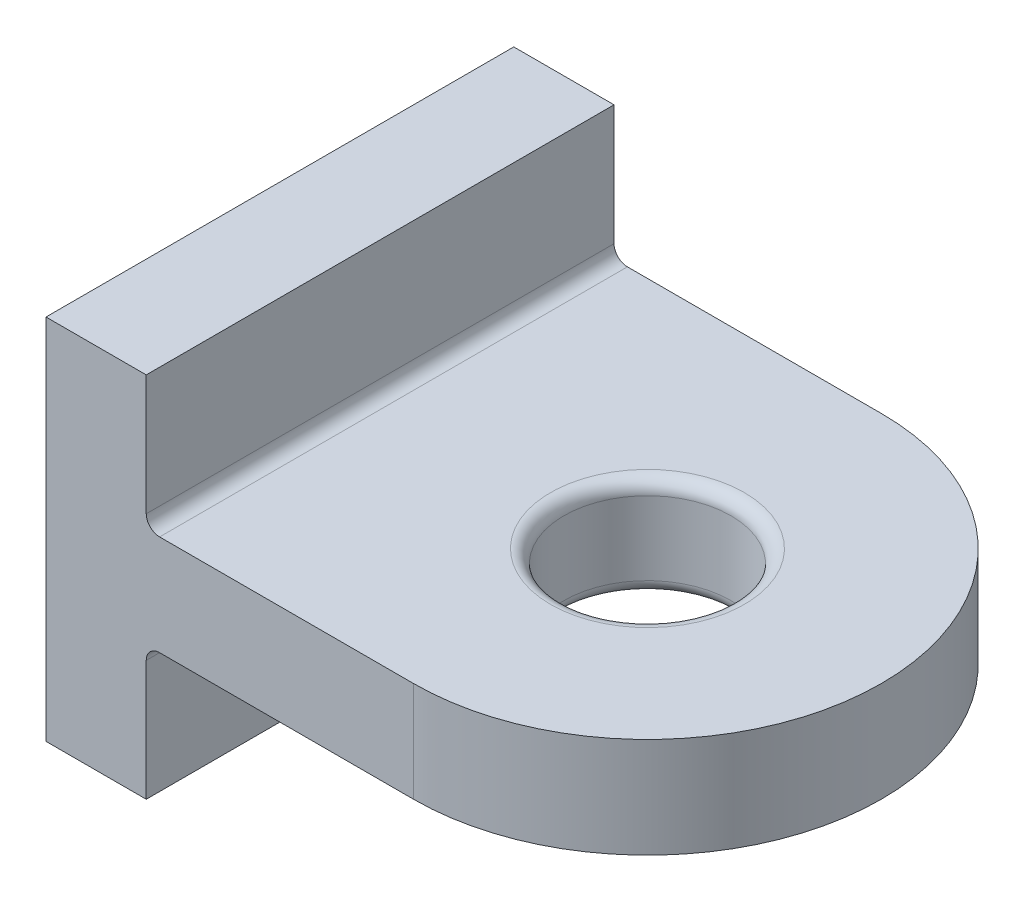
ISO-10303-21;
HEADER;
FILE_DESCRIPTION(('STEP AP214'),'2;1');
FILE_NAME('part.step','',(''),(''),'','','');
FILE_SCHEMA(('AUTOMOTIVE_DESIGN { 1 0 10303 214 1 1 1 1 }'));
ENDSEC;
DATA;
#1=APPLICATION_CONTEXT('core data for automotive mechanical design processes');
#2=APPLICATION_PROTOCOL_DEFINITION('international standard','automotive_design',2000,#1);
#3=PRODUCT_CONTEXT('',#1,'mechanical');
#4=PRODUCT('Part','Part','',(#3));
#5=PRODUCT_RELATED_PRODUCT_CATEGORY('part','',(#4));
#6=PRODUCT_DEFINITION_FORMATION('','',#4);
#7=PRODUCT_DEFINITION_CONTEXT('part definition',#1,'design');
#8=PRODUCT_DEFINITION('design','',#6,#7);
#9=PRODUCT_DEFINITION_SHAPE('','',#8);
#10=(LENGTH_UNIT() NAMED_UNIT(*) SI_UNIT(.MILLI.,.METRE.));
#11=(NAMED_UNIT(*) PLANE_ANGLE_UNIT() SI_UNIT($,.RADIAN.));
#12=(NAMED_UNIT(*) SI_UNIT($,.STERADIAN.) SOLID_ANGLE_UNIT());
#13=UNCERTAINTY_MEASURE_WITH_UNIT(LENGTH_MEASURE(1.E-05),#10,'distance_accuracy_value','');
#14=(GEOMETRIC_REPRESENTATION_CONTEXT(3) GLOBAL_UNCERTAINTY_ASSIGNED_CONTEXT((#13)) GLOBAL_UNIT_ASSIGNED_CONTEXT((#10,
#11,#12)) REPRESENTATION_CONTEXT('',''));
#15=CARTESIAN_POINT('',(0.,0.,0.));
#16=DIRECTION('',(0.,0.,1.));
#17=DIRECTION('',(1.,0.,0.));
#18=AXIS2_PLACEMENT_3D('',#15,#16,#17);
#19=CARTESIAN_POINT('',(19.05,-44.45,44.45));
#20=DIRECTION('',(1.,0.,0.));
#21=DIRECTION('',(0.,0.,-1.));
#22=AXIS2_PLACEMENT_3D('',#19,#20,#21);
#23=PLANE('',#22);
#24=DIRECTION('',(0.,1.,0.));
#25=VECTOR('',#24,1.);
#26=CARTESIAN_POINT('',(19.05,0.,-44.45));
#27=LINE('',#26,#25);
#28=CARTESIAN_POINT('',(19.05,-44.45,-44.45));
#29=VERTEX_POINT('',#28);
#30=CARTESIAN_POINT('',(19.05,-21.59,-44.45));
#31=VERTEX_POINT('',#30);
#32=EDGE_CURVE('E220',#29,#31,#27,.T.);
#33=ORIENTED_EDGE('',*,*,#32,.T.);
#34=DIRECTION('',(0.,0.,1.));
#35=VECTOR('',#34,1.);
#36=CARTESIAN_POINT('',(19.05,-21.59,44.45));
#37=LINE('',#36,#35);
#38=CARTESIAN_POINT('',(19.05,-21.59,44.45));
#39=VERTEX_POINT('',#38);
#40=EDGE_CURVE('E166',#31,#39,#37,.T.);
#41=ORIENTED_EDGE('',*,*,#40,.T.);
#42=DIRECTION('',(0.,-1.,0.));
#43=VECTOR('',#42,1.);
#44=CARTESIAN_POINT('',(19.05,0.,44.45));
#45=LINE('',#44,#43);
#46=CARTESIAN_POINT('',(19.05,-44.45,44.45));
#47=VERTEX_POINT('',#46);
#48=EDGE_CURVE('E121',#39,#47,#45,.T.);
#49=ORIENTED_EDGE('',*,*,#48,.T.);
#50=DIRECTION('',(0.,0.,-1.));
#51=VECTOR('',#50,1.);
#52=CARTESIAN_POINT('',(19.05,-44.45,44.45));
#53=LINE('',#52,#51);
#54=EDGE_CURVE('E160',#47,#29,#53,.T.);
#55=ORIENTED_EDGE('',*,*,#54,.T.);
#56=EDGE_LOOP('',(#33,#41,#49,#55));
#57=FACE_BOUND('',#56,.T.);
#58=ADVANCED_FACE('F34',(#57),#23,.T.);
#59=CARTESIAN_POINT('',(19.05,0.,44.45));
#60=DIRECTION('',(0.,0.,-1.));
#61=DIRECTION('',(0.,1.,0.));
#62=AXIS2_PLACEMENT_3D('',#59,#60,#61);
#63=PLANE('',#62);
#64=DIRECTION('',(0.,-1.,0.));
#65=VECTOR('',#64,1.);
#66=CARTESIAN_POINT('',(0.,0.,44.45));
#67=LINE('',#66,#65);
#68=CARTESIAN_POINT('',(0.,25.4,44.45));
#69=VERTEX_POINT('',#68);
#70=CARTESIAN_POINT('',(0.,-44.45,44.45));
#71=VERTEX_POINT('',#70);
#72=EDGE_CURVE('E135',#69,#71,#67,.T.);
#73=ORIENTED_EDGE('',*,*,#72,.T.);
#74=DIRECTION('',(-1.,0.,0.));
#75=VECTOR('',#74,1.);
#76=CARTESIAN_POINT('',(19.05,-44.45,44.45));
#77=LINE('',#76,#75);
#78=EDGE_CURVE('E206',#47,#71,#77,.T.);
#79=ORIENTED_EDGE('',*,*,#78,.F.);
#80=ORIENTED_EDGE('',*,*,#48,.F.);
#81=CARTESIAN_POINT('',(21.59,-21.59,44.45));
#82=DIRECTION('',(0.,0.,-1.));
#83=DIRECTION('',(0.,1.,0.));
#84=AXIS2_PLACEMENT_3D('',#81,#82,#83);
#85=CIRCLE('',#84,2.54);
#86=CARTESIAN_POINT('',(21.59,-19.05,44.45));
#87=VERTEX_POINT('',#86);
#88=EDGE_CURVE('E42',#39,#87,#85,.T.);
#89=ORIENTED_EDGE('',*,*,#88,.T.);
#90=DIRECTION('',(1.,0.,0.));
#91=VECTOR('',#90,1.);
#92=CARTESIAN_POINT('',(69.85,-19.05,44.45));
#93=LINE('',#92,#91);
#94=CARTESIAN_POINT('',(69.85,-19.05,44.45));
#95=VERTEX_POINT('',#94);
#96=EDGE_CURVE('E148',#87,#95,#93,.T.);
#97=ORIENTED_EDGE('',*,*,#96,.T.);
#98=DIRECTION('',(0.,1.,0.));
#99=VECTOR('',#98,1.);
#100=CARTESIAN_POINT('',(69.85,-19.05,44.45));
#101=LINE('',#100,#99);
#102=CARTESIAN_POINT('',(69.85,0.,44.45));
#103=VERTEX_POINT('',#102);
#104=EDGE_CURVE('E155',#95,#103,#101,.T.);
#105=ORIENTED_EDGE('',*,*,#104,.T.);
#106=DIRECTION('',(-1.,0.,0.));
#107=VECTOR('',#106,1.);
#108=CARTESIAN_POINT('',(19.05,0.,44.45));
#109=LINE('',#108,#107);
#110=CARTESIAN_POINT('',(21.59,0.,44.45));
#111=VERTEX_POINT('',#110);
#112=EDGE_CURVE('E215',#103,#111,#109,.T.);
#113=ORIENTED_EDGE('',*,*,#112,.T.);
#114=CARTESIAN_POINT('',(21.59,2.54,44.45));
#115=DIRECTION('',(0.,0.,-1.));
#116=DIRECTION('',(0.,1.,0.));
#117=AXIS2_PLACEMENT_3D('',#114,#115,#116);
#118=CIRCLE('',#117,2.54);
#119=CARTESIAN_POINT('',(19.05,2.54,44.45));
#120=VERTEX_POINT('',#119);
#121=EDGE_CURVE('E168',#111,#120,#118,.T.);
#122=ORIENTED_EDGE('',*,*,#121,.T.);
#123=DIRECTION('',(0.,1.,0.));
#124=VECTOR('',#123,1.);
#125=CARTESIAN_POINT('',(19.05,0.,44.45));
#126=LINE('',#125,#124);
#127=CARTESIAN_POINT('',(19.05,25.4,44.45));
#128=VERTEX_POINT('',#127);
#129=EDGE_CURVE('E137',#120,#128,#126,.T.);
#130=ORIENTED_EDGE('',*,*,#129,.T.);
#131=DIRECTION('',(-1.,0.,0.));
#132=VECTOR('',#131,1.);
#133=CARTESIAN_POINT('',(111.507395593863,25.4,44.45));
#134=LINE('',#133,#132);
#135=EDGE_CURVE('E139',#128,#69,#134,.T.);
#136=ORIENTED_EDGE('',*,*,#135,.T.);
#137=EDGE_LOOP('',(#73,#79,#80,#89,#97,#105,#113,#122,#130,#136));
#138=FACE_BOUND('',#137,.T.);
#139=ADVANCED_FACE('F174',(#138),#63,.F.);
#140=CARTESIAN_POINT('',(19.05,-44.45,44.45));
#141=DIRECTION('',(0.,1.,0.));
#142=DIRECTION('',(0.,0.,1.));
#143=AXIS2_PLACEMENT_3D('',#140,#141,#142);
#144=PLANE('',#143);
#145=DIRECTION('',(0.,0.,-1.));
#146=VECTOR('',#145,1.);
#147=CARTESIAN_POINT('',(0.,-44.45,44.45));
#148=LINE('',#147,#146);
#149=CARTESIAN_POINT('',(0.,-44.45,-44.45));
#150=VERTEX_POINT('',#149);
#151=EDGE_CURVE('E122',#71,#150,#148,.T.);
#152=ORIENTED_EDGE('',*,*,#151,.T.);
#153=DIRECTION('',(-1.,0.,0.));
#154=VECTOR('',#153,1.);
#155=CARTESIAN_POINT('',(19.05,-44.45,-44.45));
#156=LINE('',#155,#154);
#157=EDGE_CURVE('E118',#29,#150,#156,.T.);
#158=ORIENTED_EDGE('',*,*,#157,.F.);
#159=ORIENTED_EDGE('',*,*,#54,.F.);
#160=ORIENTED_EDGE('',*,*,#78,.T.);
#161=EDGE_LOOP('',(#152,#158,#159,#160));
#162=FACE_BOUND('',#161,.T.);
#163=ADVANCED_FACE('F236',(#162),#144,.F.);
#164=CARTESIAN_POINT('',(19.05,0.,-44.45));
#165=DIRECTION('',(0.,0.,1.));
#166=DIRECTION('',(0.,-1.,0.));
#167=AXIS2_PLACEMENT_3D('',#164,#165,#166);
#168=PLANE('',#167);
#169=DIRECTION('',(0.,1.,0.));
#170=VECTOR('',#169,1.);
#171=CARTESIAN_POINT('',(0.,0.,-44.45));
#172=LINE('',#171,#170);
#173=CARTESIAN_POINT('',(0.,25.4,-44.45));
#174=VERTEX_POINT('',#173);
#175=EDGE_CURVE('E111',#150,#174,#172,.T.);
#176=ORIENTED_EDGE('',*,*,#175,.T.);
#177=DIRECTION('',(-1.,0.,0.));
#178=VECTOR('',#177,1.);
#179=CARTESIAN_POINT('',(111.507395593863,25.4,-44.45));
#180=LINE('',#179,#178);
#181=CARTESIAN_POINT('',(19.05,25.4,-44.45));
#182=VERTEX_POINT('',#181);
#183=EDGE_CURVE('E115',#182,#174,#180,.T.);
#184=ORIENTED_EDGE('',*,*,#183,.F.);
#185=DIRECTION('',(0.,-1.,0.));
#186=VECTOR('',#185,1.);
#187=CARTESIAN_POINT('',(19.05,0.,-44.45));
#188=LINE('',#187,#186);
#189=CARTESIAN_POINT('',(19.05,2.54,-44.45));
#190=VERTEX_POINT('',#189);
#191=EDGE_CURVE('E131',#182,#190,#188,.T.);
#192=ORIENTED_EDGE('',*,*,#191,.T.);
#193=CARTESIAN_POINT('',(21.59,2.54,-44.45));
#194=DIRECTION('',(0.,0.,1.));
#195=DIRECTION('',(0.,-1.,0.));
#196=AXIS2_PLACEMENT_3D('',#193,#194,#195);
#197=CIRCLE('',#196,2.54);
#198=CARTESIAN_POINT('',(21.59,0.,-44.45));
#199=VERTEX_POINT('',#198);
#200=EDGE_CURVE('E170',#190,#199,#197,.T.);
#201=ORIENTED_EDGE('',*,*,#200,.T.);
#202=DIRECTION('',(-1.,0.,0.));
#203=VECTOR('',#202,1.);
#204=CARTESIAN_POINT('',(19.05,0.,-44.45));
#205=LINE('',#204,#203);
#206=CARTESIAN_POINT('',(69.85,0.,-44.45));
#207=VERTEX_POINT('',#206);
#208=EDGE_CURVE('E196',#207,#199,#205,.T.);
#209=ORIENTED_EDGE('',*,*,#208,.F.);
#210=DIRECTION('',(0.,1.,0.));
#211=VECTOR('',#210,1.);
#212=CARTESIAN_POINT('',(69.85,-19.05,-44.45));
#213=LINE('',#212,#211);
#214=CARTESIAN_POINT('',(69.85,-19.05,-44.45));
#215=VERTEX_POINT('',#214);
#216=EDGE_CURVE('E152',#215,#207,#213,.T.);
#217=ORIENTED_EDGE('',*,*,#216,.F.);
#218=DIRECTION('',(-1.,0.,0.));
#219=VECTOR('',#218,1.);
#220=CARTESIAN_POINT('',(19.05,-19.05,-44.45));
#221=LINE('',#220,#219);
#222=CARTESIAN_POINT('',(21.59,-19.05,-44.45));
#223=VERTEX_POINT('',#222);
#224=EDGE_CURVE('E147',#215,#223,#221,.T.);
#225=ORIENTED_EDGE('',*,*,#224,.T.);
#226=CARTESIAN_POINT('',(21.59,-21.59,-44.45));
#227=DIRECTION('',(0.,0.,1.));
#228=DIRECTION('',(0.,-1.,0.));
#229=AXIS2_PLACEMENT_3D('',#226,#227,#228);
#230=CIRCLE('',#229,2.54);
#231=EDGE_CURVE('E11',#223,#31,#230,.T.);
#232=ORIENTED_EDGE('',*,*,#231,.T.);
#233=ORIENTED_EDGE('',*,*,#32,.F.);
#234=ORIENTED_EDGE('',*,*,#157,.T.);
#235=EDGE_LOOP('',(#176,#184,#192,#201,#209,#217,#225,#232,#233,#234));
#236=FACE_BOUND('',#235,.T.);
#237=ADVANCED_FACE('F113',(#236),#168,.F.);
#238=CARTESIAN_POINT('',(19.05,0.,44.45));
#239=DIRECTION('',(0.,-1.,0.));
#240=DIRECTION('',(0.,0.,-1.));
#241=AXIS2_PLACEMENT_3D('',#238,#239,#240);
#242=PLANE('',#241);
#243=CARTESIAN_POINT('',(69.85,0.,0.));
#244=DIRECTION('',(0.,-1.,0.));
#245=DIRECTION('',(0.,0.,-1.));
#246=AXIS2_PLACEMENT_3D('',#243,#244,#245);
#247=CIRCLE('',#246,18.415);
#248=CARTESIAN_POINT('',(69.85,0.,-18.415));
#249=VERTEX_POINT('',#248);
#250=EDGE_CURVE('E184',#249,#249,#247,.T.);
#251=ORIENTED_EDGE('',*,*,#250,.T.);
#252=EDGE_LOOP('',(#251));
#253=FACE_BOUND('',#252,.T.);
#254=ORIENTED_EDGE('',*,*,#208,.T.);
#255=DIRECTION('',(0.,0.,1.));
#256=VECTOR('',#255,1.);
#257=CARTESIAN_POINT('',(21.59,0.,44.45));
#258=LINE('',#257,#256);
#259=EDGE_CURVE('E189',#199,#111,#258,.T.);
#260=ORIENTED_EDGE('',*,*,#259,.T.);
#261=ORIENTED_EDGE('',*,*,#112,.F.);
#262=CARTESIAN_POINT('',(69.85,0.,0.));
#263=DIRECTION('',(0.,1.,0.));
#264=DIRECTION('',(0.,0.,-1.));
#265=AXIS2_PLACEMENT_3D('',#262,#263,#264);
#266=CIRCLE('',#265,44.45);
#267=EDGE_CURVE('E149',#103,#207,#266,.T.);
#268=ORIENTED_EDGE('',*,*,#267,.T.);
#269=EDGE_LOOP('',(#254,#260,#261,#268));
#270=FACE_BOUND('',#269,.T.);
#271=ADVANCED_FACE('F214',(#253,#270),#242,.F.);
#272=CARTESIAN_POINT('',(0.,-44.45,44.45));
#273=DIRECTION('',(1.,0.,0.));
#274=DIRECTION('',(0.,0.,-1.));
#275=AXIS2_PLACEMENT_3D('',#272,#273,#274);
#276=PLANE('',#275);
#277=ORIENTED_EDGE('',*,*,#72,.F.);
#278=DIRECTION('',(0.,0.,-1.));
#279=VECTOR('',#278,1.);
#280=CARTESIAN_POINT('',(0.,25.4,-44.45));
#281=LINE('',#280,#279);
#282=EDGE_CURVE('E128',#69,#174,#281,.T.);
#283=ORIENTED_EDGE('',*,*,#282,.T.);
#284=ORIENTED_EDGE('',*,*,#175,.F.);
#285=ORIENTED_EDGE('',*,*,#151,.F.);
#286=EDGE_LOOP('',(#277,#283,#284,#285));
#287=FACE_BOUND('',#286,.T.);
#288=ADVANCED_FACE('F133',(#287),#276,.F.);
#289=CARTESIAN_POINT('',(69.85,-19.05,0.));
#290=DIRECTION('',(0.,1.,0.));
#291=DIRECTION('',(0.,0.,1.));
#292=AXIS2_PLACEMENT_3D('',#289,#290,#291);
#293=CYLINDRICAL_SURFACE('',#292,44.45);
#294=ORIENTED_EDGE('',*,*,#267,.F.);
#295=ORIENTED_EDGE('',*,*,#104,.F.);
#296=CARTESIAN_POINT('',(69.85,-19.05,0.));
#297=DIRECTION('',(0.,1.,0.));
#298=DIRECTION('',(0.,0.,-1.));
#299=AXIS2_PLACEMENT_3D('',#296,#297,#298);
#300=CIRCLE('',#299,44.45);
#301=EDGE_CURVE('E144',#95,#215,#300,.T.);
#302=ORIENTED_EDGE('',*,*,#301,.T.);
#303=ORIENTED_EDGE('',*,*,#216,.T.);
#304=EDGE_LOOP('',(#294,#295,#302,#303));
#305=FACE_BOUND('',#304,.T.);
#306=ADVANCED_FACE('F260',(#305),#293,.T.);
#307=CARTESIAN_POINT('',(69.85,-19.05,0.));
#308=DIRECTION('',(0.,-1.,0.));
#309=DIRECTION('',(0.,0.,-1.));
#310=AXIS2_PLACEMENT_3D('',#307,#308,#309);
#311=PLANE('',#310);
#312=CARTESIAN_POINT('',(69.85,-19.05,0.));
#313=DIRECTION('',(0.,-1.,0.));
#314=DIRECTION('',(0.,0.,-1.));
#315=AXIS2_PLACEMENT_3D('',#312,#313,#314);
#316=CIRCLE('',#315,18.415);
#317=CARTESIAN_POINT('',(69.85,-19.05,-18.415));
#318=VERTEX_POINT('',#317);
#319=EDGE_CURVE('E183',#318,#318,#316,.F.);
#320=ORIENTED_EDGE('',*,*,#319,.T.);
#321=EDGE_LOOP('',(#320));
#322=FACE_BOUND('',#321,.T.);
#323=ORIENTED_EDGE('',*,*,#96,.F.);
#324=DIRECTION('',(0.,0.,1.));
#325=VECTOR('',#324,1.);
#326=CARTESIAN_POINT('',(21.59,-19.05,-44.45));
#327=LINE('',#326,#325);
#328=EDGE_CURVE('E181',#87,#223,#327,.F.);
#329=ORIENTED_EDGE('',*,*,#328,.T.);
#330=ORIENTED_EDGE('',*,*,#224,.F.);
#331=ORIENTED_EDGE('',*,*,#301,.F.);
#332=EDGE_LOOP('',(#323,#329,#330,#331));
#333=FACE_BOUND('',#332,.T.);
#334=ADVANCED_FACE('F179',(#322,#333),#311,.T.);
#335=CARTESIAN_POINT('',(69.85,-44.450025,0.));
#336=DIRECTION('',(0.,1.,0.));
#337=DIRECTION('',(0.,0.,1.));
#338=AXIS2_PLACEMENT_3D('',#335,#336,#337);
#339=CYLINDRICAL_SURFACE('',#338,15.875);
#340=CARTESIAN_POINT('',(69.85,-2.54,0.));
#341=DIRECTION('',(0.,-1.,0.));
#342=DIRECTION('',(0.,0.,-1.));
#343=AXIS2_PLACEMENT_3D('',#340,#341,#342);
#344=CIRCLE('',#343,15.875);
#345=CARTESIAN_POINT('',(69.85,-2.54,-15.875));
#346=VERTEX_POINT('',#345);
#347=EDGE_CURVE('E205',#346,#346,#344,.F.);
#348=ORIENTED_EDGE('',*,*,#347,.T.);
#349=EDGE_LOOP('',(#348));
#350=FACE_BOUND('',#349,.T.);
#351=CARTESIAN_POINT('',(69.85,-16.51,0.));
#352=DIRECTION('',(0.,-1.,0.));
#353=DIRECTION('',(0.,0.,-1.));
#354=AXIS2_PLACEMENT_3D('',#351,#352,#353);
#355=CIRCLE('',#354,15.875);
#356=CARTESIAN_POINT('',(69.85,-16.51,-15.875));
#357=VERTEX_POINT('',#356);
#358=EDGE_CURVE('E202',#357,#357,#355,.T.);
#359=ORIENTED_EDGE('',*,*,#358,.T.);
#360=EDGE_LOOP('',(#359));
#361=FACE_BOUND('',#360,.T.);
#362=ADVANCED_FACE('F281',(#350,#361),#339,.F.);
#363=CARTESIAN_POINT('',(19.05,-44.45,44.45));
#364=DIRECTION('',(1.,0.,0.));
#365=DIRECTION('',(0.,0.,-1.));
#366=AXIS2_PLACEMENT_3D('',#363,#364,#365);
#367=PLANE('',#366);
#368=ORIENTED_EDGE('',*,*,#129,.F.);
#369=DIRECTION('',(0.,0.,1.));
#370=VECTOR('',#369,1.);
#371=CARTESIAN_POINT('',(19.05,2.54,44.45));
#372=LINE('',#371,#370);
#373=EDGE_CURVE('E165',#120,#190,#372,.F.);
#374=ORIENTED_EDGE('',*,*,#373,.T.);
#375=ORIENTED_EDGE('',*,*,#191,.F.);
#376=DIRECTION('',(0.,0.,-1.));
#377=VECTOR('',#376,1.);
#378=CARTESIAN_POINT('',(19.05,25.4,-44.45));
#379=LINE('',#378,#377);
#380=EDGE_CURVE('E130',#128,#182,#379,.T.);
#381=ORIENTED_EDGE('',*,*,#380,.F.);
#382=EDGE_LOOP('',(#368,#374,#375,#381));
#383=FACE_BOUND('',#382,.T.);
#384=ADVANCED_FACE('F240',(#383),#367,.T.);
#385=CARTESIAN_POINT('',(111.507395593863,25.4,-44.45));
#386=DIRECTION('',(0.,1.,0.));
#387=DIRECTION('',(0.,0.,1.));
#388=AXIS2_PLACEMENT_3D('',#385,#386,#387);
#389=PLANE('',#388);
#390=ORIENTED_EDGE('',*,*,#135,.F.);
#391=ORIENTED_EDGE('',*,*,#380,.T.);
#392=ORIENTED_EDGE('',*,*,#183,.T.);
#393=ORIENTED_EDGE('',*,*,#282,.F.);
#394=EDGE_LOOP('',(#390,#391,#392,#393));
#395=FACE_BOUND('',#394,.T.);
#396=ADVANCED_FACE('F127',(#395),#389,.T.);
#397=CARTESIAN_POINT('',(69.85,-2.54,0.));
#398=DIRECTION('',(0.,-1.,0.));
#399=DIRECTION('',(0.,0.,-1.));
#400=AXIS2_PLACEMENT_3D('',#397,#398,#399);
#401=TOROIDAL_SURFACE('',#400,18.415,2.54);
#402=ORIENTED_EDGE('',*,*,#250,.F.);
#403=EDGE_LOOP('',(#402));
#404=FACE_BOUND('',#403,.T.);
#405=ORIENTED_EDGE('',*,*,#347,.F.);
#406=EDGE_LOOP('',(#405));
#407=FACE_BOUND('',#406,.T.);
#408=ADVANCED_FACE('F248',(#404,#407),#401,.T.);
#409=CARTESIAN_POINT('',(69.85,-16.51,0.));
#410=DIRECTION('',(0.,-1.,0.));
#411=DIRECTION('',(0.,0.,-1.));
#412=AXIS2_PLACEMENT_3D('',#409,#410,#411);
#413=TOROIDAL_SURFACE('',#412,18.415,2.54);
#414=ORIENTED_EDGE('',*,*,#319,.F.);
#415=EDGE_LOOP('',(#414));
#416=FACE_BOUND('',#415,.T.);
#417=ORIENTED_EDGE('',*,*,#358,.F.);
#418=EDGE_LOOP('',(#417));
#419=FACE_BOUND('',#418,.T.);
#420=ADVANCED_FACE('F243',(#416,#419),#413,.T.);
#421=CARTESIAN_POINT('',(21.59,2.54,44.45));
#422=DIRECTION('',(0.,0.,1.));
#423=DIRECTION('',(1.,0.,0.));
#424=AXIS2_PLACEMENT_3D('',#421,#422,#423);
#425=CYLINDRICAL_SURFACE('',#424,2.54);
#426=ORIENTED_EDGE('',*,*,#200,.F.);
#427=ORIENTED_EDGE('',*,*,#373,.F.);
#428=ORIENTED_EDGE('',*,*,#121,.F.);
#429=ORIENTED_EDGE('',*,*,#259,.F.);
#430=EDGE_LOOP('',(#426,#427,#428,#429));
#431=FACE_BOUND('',#430,.T.);
#432=ADVANCED_FACE('F241',(#431),#425,.F.);
#433=CARTESIAN_POINT('',(21.59,-21.59,44.45));
#434=DIRECTION('',(0.,0.,-1.));
#435=DIRECTION('',(-1.,0.,0.));
#436=AXIS2_PLACEMENT_3D('',#433,#434,#435);
#437=CYLINDRICAL_SURFACE('',#436,2.54);
#438=ORIENTED_EDGE('',*,*,#231,.F.);
#439=ORIENTED_EDGE('',*,*,#328,.F.);
#440=ORIENTED_EDGE('',*,*,#88,.F.);
#441=ORIENTED_EDGE('',*,*,#40,.F.);
#442=EDGE_LOOP('',(#438,#439,#440,#441));
#443=FACE_BOUND('',#442,.T.);
#444=ADVANCED_FACE('F36',(#443),#437,.F.);
#445=CLOSED_SHELL('',(#58,#139,#163,#237,#271,#288,#306,#334,#362,#384,#396,#408,#420,#432,#444));
#446=MANIFOLD_SOLID_BREP('B2',#445);
#447=ADVANCED_BREP_SHAPE_REPRESENTATION('',(#18,#446),#14);
#448=SHAPE_DEFINITION_REPRESENTATION(#9,#447);
ENDSEC;
END-ISO-10303-21;
